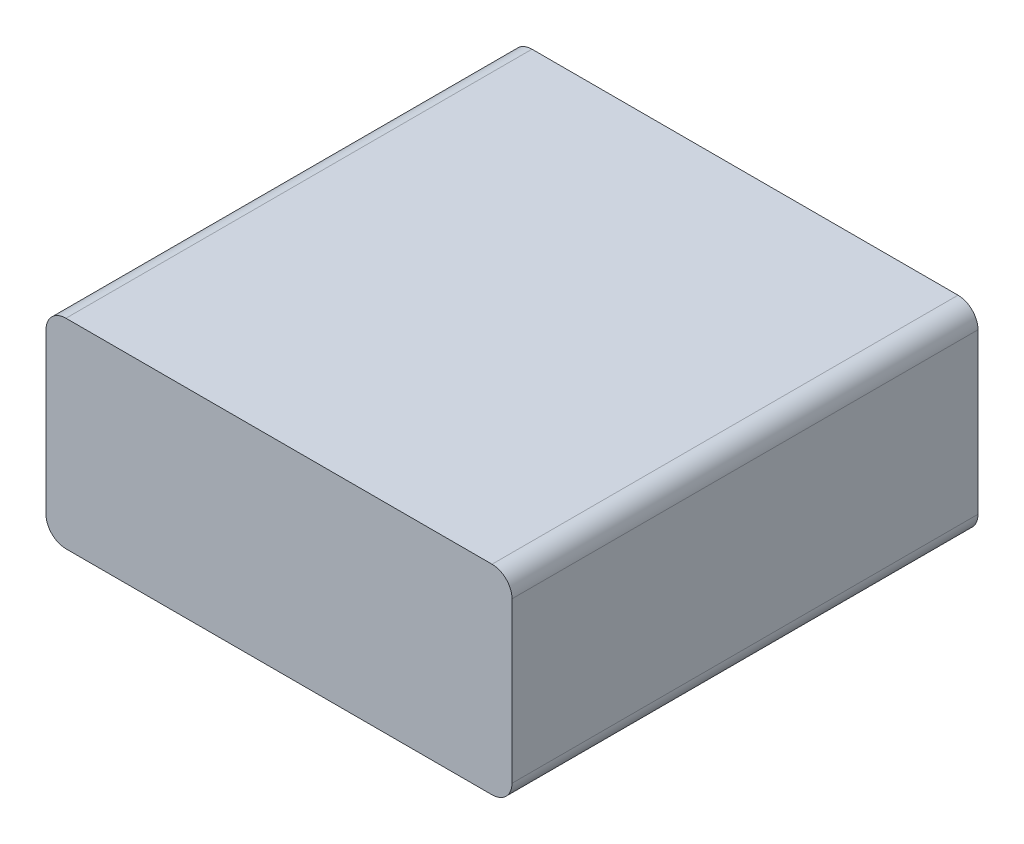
ISO-10303-21;
HEADER;
FILE_DESCRIPTION(('STEP AP214'),'2;1');
FILE_NAME('part.step','',(''),(''),'','','');
FILE_SCHEMA(('AUTOMOTIVE_DESIGN { 1 0 10303 214 1 1 1 1 }'));
ENDSEC;
DATA;
#1=APPLICATION_CONTEXT('core data for automotive mechanical design processes');
#2=APPLICATION_PROTOCOL_DEFINITION('international standard','automotive_design',2000,#1);
#3=PRODUCT_CONTEXT('',#1,'mechanical');
#4=PRODUCT('Part','Part','',(#3));
#5=PRODUCT_RELATED_PRODUCT_CATEGORY('part','',(#4));
#6=PRODUCT_DEFINITION_FORMATION('','',#4);
#7=PRODUCT_DEFINITION_CONTEXT('part definition',#1,'design');
#8=PRODUCT_DEFINITION('design','',#6,#7);
#9=PRODUCT_DEFINITION_SHAPE('','',#8);
#10=(LENGTH_UNIT() NAMED_UNIT(*) SI_UNIT(.MILLI.,.METRE.));
#11=(NAMED_UNIT(*) PLANE_ANGLE_UNIT() SI_UNIT($,.RADIAN.));
#12=(NAMED_UNIT(*) SI_UNIT($,.STERADIAN.) SOLID_ANGLE_UNIT());
#13=UNCERTAINTY_MEASURE_WITH_UNIT(LENGTH_MEASURE(1.E-05),#10,'distance_accuracy_value','');
#14=(GEOMETRIC_REPRESENTATION_CONTEXT(3) GLOBAL_UNCERTAINTY_ASSIGNED_CONTEXT((#13)) GLOBAL_UNIT_ASSIGNED_CONTEXT((#10,
#11,#12)) REPRESENTATION_CONTEXT('',''));
#15=CARTESIAN_POINT('',(0.,0.,0.));
#16=DIRECTION('',(0.,0.,1.));
#17=DIRECTION('',(1.,0.,0.));
#18=AXIS2_PLACEMENT_3D('',#15,#16,#17);
#19=CARTESIAN_POINT('',(-43.2248971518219,38.1,-44.45));
#20=DIRECTION('',(1.,0.,0.));
#21=DIRECTION('',(0.,0.,-1.));
#22=AXIS2_PLACEMENT_3D('',#19,#20,#21);
#23=PLANE('',#22);
#24=DIRECTION('',(0.,-1.,0.));
#25=VECTOR('',#24,1.);
#26=CARTESIAN_POINT('',(-43.2248971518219,38.1,-44.45));
#27=LINE('',#26,#25);
#28=CARTESIAN_POINT('',(-43.2248971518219,34.29,-44.45));
#29=VERTEX_POINT('',#28);
#30=CARTESIAN_POINT('',(-43.2248971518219,3.81000000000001,-44.45));
#31=VERTEX_POINT('',#30);
#32=EDGE_CURVE('E162',#29,#31,#27,.T.);
#33=ORIENTED_EDGE('',*,*,#32,.T.);
#34=DIRECTION('',(0.,0.,1.));
#35=VECTOR('',#34,1.);
#36=CARTESIAN_POINT('',(-43.2248971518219,3.81,-44.45));
#37=LINE('',#36,#35);
#38=CARTESIAN_POINT('',(-43.2248971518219,3.81000000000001,44.45));
#39=VERTEX_POINT('',#38);
#40=EDGE_CURVE('E118',#31,#39,#37,.T.);
#41=ORIENTED_EDGE('',*,*,#40,.T.);
#42=DIRECTION('',(0.,-1.,0.));
#43=VECTOR('',#42,1.);
#44=CARTESIAN_POINT('',(-43.2248971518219,38.1,44.45));
#45=LINE('',#44,#43);
#46=CARTESIAN_POINT('',(-43.2248971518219,34.29,44.45));
#47=VERTEX_POINT('',#46);
#48=EDGE_CURVE('E102',#47,#39,#45,.T.);
#49=ORIENTED_EDGE('',*,*,#48,.F.);
#50=DIRECTION('',(0.,0.,1.));
#51=VECTOR('',#50,1.);
#52=CARTESIAN_POINT('',(-43.2248971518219,34.29,-44.45));
#53=LINE('',#52,#51);
#54=EDGE_CURVE('E115',#47,#29,#53,.F.);
#55=ORIENTED_EDGE('',*,*,#54,.T.);
#56=EDGE_LOOP('',(#33,#41,#49,#55));
#57=FACE_BOUND('',#56,.T.);
#58=ADVANCED_FACE('F33',(#57),#23,.F.);
#59=CARTESIAN_POINT('',(-43.2248971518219,38.1,44.45));
#60=DIRECTION('',(0.,0.,-1.));
#61=DIRECTION('',(-1.,0.,0.));
#62=AXIS2_PLACEMENT_3D('',#59,#60,#61);
#63=PLANE('',#62);
#64=ORIENTED_EDGE('',*,*,#48,.T.);
#65=CARTESIAN_POINT('',(-39.4148971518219,3.81,44.45));
#66=DIRECTION('',(0.,0.,-1.));
#67=DIRECTION('',(-1.,0.,0.));
#68=AXIS2_PLACEMENT_3D('',#65,#66,#67);
#69=CIRCLE('',#68,3.81);
#70=CARTESIAN_POINT('',(-39.4148971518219,0.,44.45));
#71=VERTEX_POINT('',#70);
#72=EDGE_CURVE('E109',#39,#71,#69,.F.);
#73=ORIENTED_EDGE('',*,*,#72,.T.);
#74=DIRECTION('',(1.,0.,0.));
#75=VECTOR('',#74,1.);
#76=CARTESIAN_POINT('',(-43.2248971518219,0.,44.45));
#77=LINE('',#76,#75);
#78=CARTESIAN_POINT('',(41.8651028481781,0.,44.45));
#79=VERTEX_POINT('',#78);
#80=EDGE_CURVE('E168',#71,#79,#77,.T.);
#81=ORIENTED_EDGE('',*,*,#80,.T.);
#82=CARTESIAN_POINT('',(41.8651028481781,3.81,44.45));
#83=DIRECTION('',(0.,0.,-1.));
#84=DIRECTION('',(-1.,0.,0.));
#85=AXIS2_PLACEMENT_3D('',#82,#83,#84);
#86=CIRCLE('',#85,3.81);
#87=CARTESIAN_POINT('',(45.6751028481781,3.81000000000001,44.45));
#88=VERTEX_POINT('',#87);
#89=EDGE_CURVE('E110',#79,#88,#86,.F.);
#90=ORIENTED_EDGE('',*,*,#89,.T.);
#91=DIRECTION('',(0.,-1.,0.));
#92=VECTOR('',#91,1.);
#93=CARTESIAN_POINT('',(45.6751028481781,38.1,44.45));
#94=LINE('',#93,#92);
#95=CARTESIAN_POINT('',(45.6751028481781,34.29,44.45));
#96=VERTEX_POINT('',#95);
#97=EDGE_CURVE('E119',#96,#88,#94,.T.);
#98=ORIENTED_EDGE('',*,*,#97,.F.);
#99=CARTESIAN_POINT('',(41.8651028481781,34.29,44.45));
#100=DIRECTION('',(0.,0.,-1.));
#101=DIRECTION('',(-1.,0.,0.));
#102=AXIS2_PLACEMENT_3D('',#99,#100,#101);
#103=CIRCLE('',#102,3.81);
#104=CARTESIAN_POINT('',(41.8651028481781,38.1,44.45));
#105=VERTEX_POINT('',#104);
#106=EDGE_CURVE('E125',#96,#105,#103,.F.);
#107=ORIENTED_EDGE('',*,*,#106,.T.);
#108=DIRECTION('',(1.,0.,0.));
#109=VECTOR('',#108,1.);
#110=CARTESIAN_POINT('',(-43.2248971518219,38.1,44.45));
#111=LINE('',#110,#109);
#112=CARTESIAN_POINT('',(-39.4148971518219,38.1,44.45));
#113=VERTEX_POINT('',#112);
#114=EDGE_CURVE('E104',#113,#105,#111,.T.);
#115=ORIENTED_EDGE('',*,*,#114,.F.);
#116=CARTESIAN_POINT('',(-39.4148971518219,34.29,44.45));
#117=DIRECTION('',(0.,0.,-1.));
#118=DIRECTION('',(-1.,0.,0.));
#119=AXIS2_PLACEMENT_3D('',#116,#117,#118);
#120=CIRCLE('',#119,3.81);
#121=EDGE_CURVE('E99',#113,#47,#120,.F.);
#122=ORIENTED_EDGE('',*,*,#121,.T.);
#123=EDGE_LOOP('',(#64,#73,#81,#90,#98,#107,#115,#122));
#124=FACE_BOUND('',#123,.T.);
#125=ADVANCED_FACE('F101',(#124),#63,.F.);
#126=CARTESIAN_POINT('',(45.6751028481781,38.1,-44.45));
#127=DIRECTION('',(-1.,0.,0.));
#128=DIRECTION('',(0.,0.,1.));
#129=AXIS2_PLACEMENT_3D('',#126,#127,#128);
#130=PLANE('',#129);
#131=ORIENTED_EDGE('',*,*,#97,.T.);
#132=DIRECTION('',(0.,0.,-1.));
#133=VECTOR('',#132,1.);
#134=CARTESIAN_POINT('',(45.6751028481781,3.81,-44.45));
#135=LINE('',#134,#133);
#136=CARTESIAN_POINT('',(45.6751028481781,3.81000000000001,-44.45));
#137=VERTEX_POINT('',#136);
#138=EDGE_CURVE('E11',#88,#137,#135,.T.);
#139=ORIENTED_EDGE('',*,*,#138,.T.);
#140=DIRECTION('',(0.,-1.,0.));
#141=VECTOR('',#140,1.);
#142=CARTESIAN_POINT('',(45.6751028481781,38.1,-44.45));
#143=LINE('',#142,#141);
#144=CARTESIAN_POINT('',(45.6751028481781,34.29,-44.45));
#145=VERTEX_POINT('',#144);
#146=EDGE_CURVE('E150',#145,#137,#143,.T.);
#147=ORIENTED_EDGE('',*,*,#146,.F.);
#148=DIRECTION('',(0.,0.,-1.));
#149=VECTOR('',#148,1.);
#150=CARTESIAN_POINT('',(45.6751028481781,34.29,44.45));
#151=LINE('',#150,#149);
#152=EDGE_CURVE('E41',#145,#96,#151,.F.);
#153=ORIENTED_EDGE('',*,*,#152,.T.);
#154=EDGE_LOOP('',(#131,#139,#147,#153));
#155=FACE_BOUND('',#154,.T.);
#156=ADVANCED_FACE('F149',(#155),#130,.F.);
#157=CARTESIAN_POINT('',(-43.2248971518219,38.1,-44.45));
#158=DIRECTION('',(0.,0.,1.));
#159=DIRECTION('',(1.,0.,0.));
#160=AXIS2_PLACEMENT_3D('',#157,#158,#159);
#161=PLANE('',#160);
#162=DIRECTION('',(-1.,0.,0.));
#163=VECTOR('',#162,1.);
#164=CARTESIAN_POINT('',(-43.2248971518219,0.,-44.45));
#165=LINE('',#164,#163);
#166=CARTESIAN_POINT('',(41.8651028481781,0.,-44.45));
#167=VERTEX_POINT('',#166);
#168=CARTESIAN_POINT('',(-39.4148971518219,0.,-44.45));
#169=VERTEX_POINT('',#168);
#170=EDGE_CURVE('E165',#167,#169,#165,.T.);
#171=ORIENTED_EDGE('',*,*,#170,.T.);
#172=CARTESIAN_POINT('',(-39.4148971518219,3.81,-44.45));
#173=DIRECTION('',(0.,0.,1.));
#174=DIRECTION('',(1.,0.,0.));
#175=AXIS2_PLACEMENT_3D('',#172,#173,#174);
#176=CIRCLE('',#175,3.81);
#177=EDGE_CURVE('E139',#169,#31,#176,.F.);
#178=ORIENTED_EDGE('',*,*,#177,.T.);
#179=ORIENTED_EDGE('',*,*,#32,.F.);
#180=CARTESIAN_POINT('',(-39.4148971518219,34.29,-44.45));
#181=DIRECTION('',(0.,0.,1.));
#182=DIRECTION('',(1.,0.,0.));
#183=AXIS2_PLACEMENT_3D('',#180,#181,#182);
#184=CIRCLE('',#183,3.81);
#185=CARTESIAN_POINT('',(-39.4148971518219,38.1,-44.45));
#186=VERTEX_POINT('',#185);
#187=EDGE_CURVE('E123',#29,#186,#184,.F.);
#188=ORIENTED_EDGE('',*,*,#187,.T.);
#189=DIRECTION('',(-1.,0.,0.));
#190=VECTOR('',#189,1.);
#191=CARTESIAN_POINT('',(-43.2248971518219,38.1,-44.45));
#192=LINE('',#191,#190);
#193=CARTESIAN_POINT('',(41.8651028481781,38.1,-44.45));
#194=VERTEX_POINT('',#193);
#195=EDGE_CURVE('E159',#194,#186,#192,.T.);
#196=ORIENTED_EDGE('',*,*,#195,.F.);
#197=CARTESIAN_POINT('',(41.8651028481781,34.29,-44.45));
#198=DIRECTION('',(0.,0.,1.));
#199=DIRECTION('',(1.,0.,0.));
#200=AXIS2_PLACEMENT_3D('',#197,#198,#199);
#201=CIRCLE('',#200,3.81);
#202=EDGE_CURVE('E55',#194,#145,#201,.F.);
#203=ORIENTED_EDGE('',*,*,#202,.T.);
#204=ORIENTED_EDGE('',*,*,#146,.T.);
#205=CARTESIAN_POINT('',(41.8651028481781,3.81,-44.45));
#206=DIRECTION('',(0.,0.,1.));
#207=DIRECTION('',(1.,0.,0.));
#208=AXIS2_PLACEMENT_3D('',#205,#206,#207);
#209=CIRCLE('',#208,3.81);
#210=EDGE_CURVE('E48',#137,#167,#209,.F.);
#211=ORIENTED_EDGE('',*,*,#210,.T.);
#212=EDGE_LOOP('',(#171,#178,#179,#188,#196,#203,#204,#211));
#213=FACE_BOUND('',#212,.T.);
#214=ADVANCED_FACE('F161',(#213),#161,.F.);
#215=CARTESIAN_POINT('',(0.,38.1,0.));
#216=DIRECTION('',(0.,1.,0.));
#217=DIRECTION('',(0.,0.,1.));
#218=AXIS2_PLACEMENT_3D('',#215,#216,#217);
#219=PLANE('',#218);
#220=ORIENTED_EDGE('',*,*,#195,.T.);
#221=DIRECTION('',(0.,0.,1.));
#222=VECTOR('',#221,1.);
#223=CARTESIAN_POINT('',(-39.4148971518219,38.1,44.45));
#224=LINE('',#223,#222);
#225=EDGE_CURVE('E144',#186,#113,#224,.T.);
#226=ORIENTED_EDGE('',*,*,#225,.T.);
#227=ORIENTED_EDGE('',*,*,#114,.T.);
#228=DIRECTION('',(0.,0.,-1.));
#229=VECTOR('',#228,1.);
#230=CARTESIAN_POINT('',(41.8651028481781,38.1,-44.45));
#231=LINE('',#230,#229);
#232=EDGE_CURVE('E141',#105,#194,#231,.T.);
#233=ORIENTED_EDGE('',*,*,#232,.T.);
#234=EDGE_LOOP('',(#220,#226,#227,#233));
#235=FACE_BOUND('',#234,.T.);
#236=ADVANCED_FACE('F158',(#235),#219,.T.);
#237=CARTESIAN_POINT('',(0.,0.,0.));
#238=DIRECTION('',(0.,1.,0.));
#239=DIRECTION('',(0.,0.,1.));
#240=AXIS2_PLACEMENT_3D('',#237,#238,#239);
#241=PLANE('',#240);
#242=ORIENTED_EDGE('',*,*,#80,.F.);
#243=DIRECTION('',(0.,0.,1.));
#244=VECTOR('',#243,1.);
#245=CARTESIAN_POINT('',(-39.4148971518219,0.,0.));
#246=LINE('',#245,#244);
#247=EDGE_CURVE('E134',#71,#169,#246,.F.);
#248=ORIENTED_EDGE('',*,*,#247,.T.);
#249=ORIENTED_EDGE('',*,*,#170,.F.);
#250=DIRECTION('',(0.,0.,-1.));
#251=VECTOR('',#250,1.);
#252=CARTESIAN_POINT('',(41.8651028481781,0.,0.));
#253=LINE('',#252,#251);
#254=EDGE_CURVE('E132',#167,#79,#253,.F.);
#255=ORIENTED_EDGE('',*,*,#254,.T.);
#256=EDGE_LOOP('',(#242,#248,#249,#255));
#257=FACE_BOUND('',#256,.T.);
#258=ADVANCED_FACE('F175',(#257),#241,.F.);
#259=CARTESIAN_POINT('',(-39.4148971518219,3.81,-44.45));
#260=DIRECTION('',(0.,0.,1.));
#261=DIRECTION('',(1.,0.,0.));
#262=AXIS2_PLACEMENT_3D('',#259,#260,#261);
#263=CYLINDRICAL_SURFACE('',#262,3.81);
#264=ORIENTED_EDGE('',*,*,#177,.F.);
#265=ORIENTED_EDGE('',*,*,#247,.F.);
#266=ORIENTED_EDGE('',*,*,#72,.F.);
#267=ORIENTED_EDGE('',*,*,#40,.F.);
#268=EDGE_LOOP('',(#264,#265,#266,#267));
#269=FACE_BOUND('',#268,.T.);
#270=ADVANCED_FACE('F183',(#269),#263,.T.);
#271=CARTESIAN_POINT('',(-39.4148971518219,34.29,0.));
#272=DIRECTION('',(0.,0.,-1.));
#273=DIRECTION('',(-1.,0.,0.));
#274=AXIS2_PLACEMENT_3D('',#271,#272,#273);
#275=CYLINDRICAL_SURFACE('',#274,3.81);
#276=ORIENTED_EDGE('',*,*,#187,.F.);
#277=ORIENTED_EDGE('',*,*,#54,.F.);
#278=ORIENTED_EDGE('',*,*,#121,.F.);
#279=ORIENTED_EDGE('',*,*,#225,.F.);
#280=EDGE_LOOP('',(#276,#277,#278,#279));
#281=FACE_BOUND('',#280,.T.);
#282=ADVANCED_FACE('F122',(#281),#275,.T.);
#283=CARTESIAN_POINT('',(41.8651028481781,3.81,-44.45));
#284=DIRECTION('',(0.,0.,-1.));
#285=DIRECTION('',(-1.,0.,0.));
#286=AXIS2_PLACEMENT_3D('',#283,#284,#285);
#287=CYLINDRICAL_SURFACE('',#286,3.81);
#288=ORIENTED_EDGE('',*,*,#89,.F.);
#289=ORIENTED_EDGE('',*,*,#254,.F.);
#290=ORIENTED_EDGE('',*,*,#210,.F.);
#291=ORIENTED_EDGE('',*,*,#138,.F.);
#292=EDGE_LOOP('',(#288,#289,#290,#291));
#293=FACE_BOUND('',#292,.T.);
#294=ADVANCED_FACE('F177',(#293),#287,.T.);
#295=CARTESIAN_POINT('',(41.8651028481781,34.29,0.));
#296=DIRECTION('',(0.,0.,1.));
#297=DIRECTION('',(1.,0.,0.));
#298=AXIS2_PLACEMENT_3D('',#295,#296,#297);
#299=CYLINDRICAL_SURFACE('',#298,3.81);
#300=ORIENTED_EDGE('',*,*,#106,.F.);
#301=ORIENTED_EDGE('',*,*,#152,.F.);
#302=ORIENTED_EDGE('',*,*,#202,.F.);
#303=ORIENTED_EDGE('',*,*,#232,.F.);
#304=EDGE_LOOP('',(#300,#301,#302,#303));
#305=FACE_BOUND('',#304,.T.);
#306=ADVANCED_FACE('F35',(#305),#299,.T.);
#307=CLOSED_SHELL('',(#58,#125,#156,#214,#236,#258,#270,#282,#294,#306));
#308=MANIFOLD_SOLID_BREP('B2',#307);
#309=ADVANCED_BREP_SHAPE_REPRESENTATION('',(#18,#308),#14);
#310=SHAPE_DEFINITION_REPRESENTATION(#9,#309);
ENDSEC;
END-ISO-10303-21;
